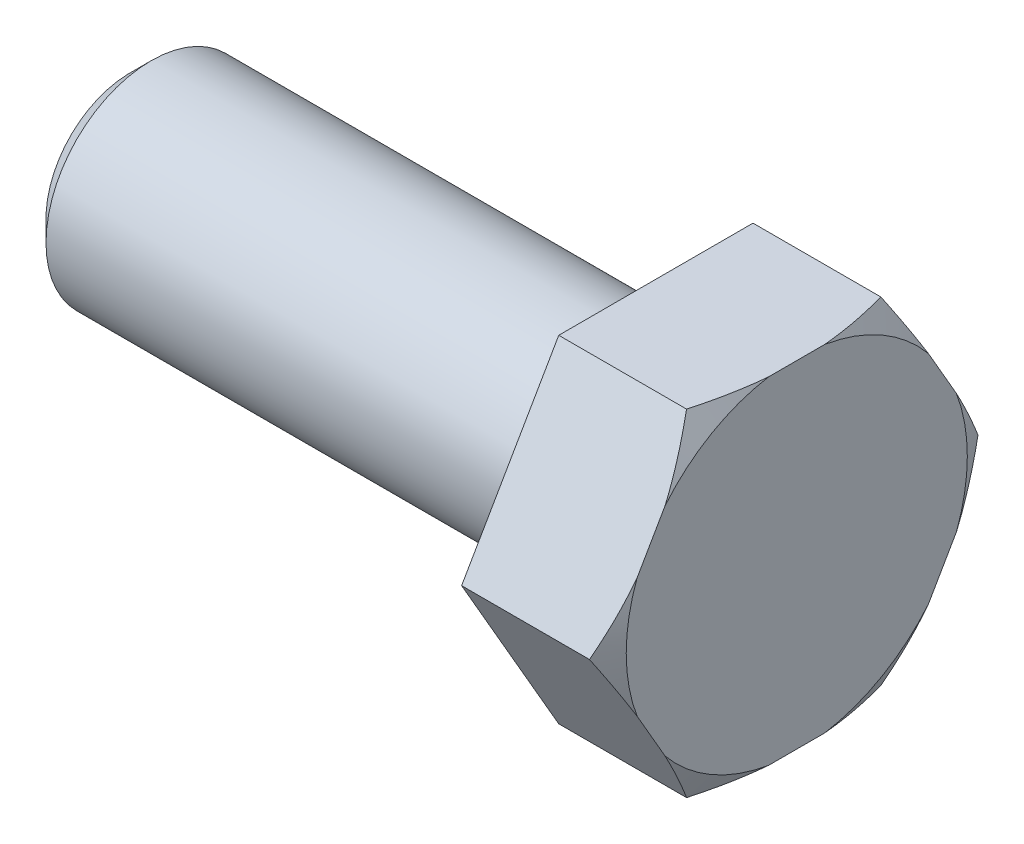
ISO-10303-21;
HEADER;
FILE_DESCRIPTION(('STEP AP214'),'2;1');
FILE_NAME('part.step','',(''),(''),'','','');
FILE_SCHEMA(('AUTOMOTIVE_DESIGN { 1 0 10303 214 1 1 1 1 }'));
ENDSEC;
DATA;
#1=APPLICATION_CONTEXT('core data for automotive mechanical design processes');
#2=APPLICATION_PROTOCOL_DEFINITION('international standard','automotive_design',2000,#1);
#3=PRODUCT_CONTEXT('',#1,'mechanical');
#4=PRODUCT('Part','Part','',(#3));
#5=PRODUCT_RELATED_PRODUCT_CATEGORY('part','',(#4));
#6=PRODUCT_DEFINITION_FORMATION('','',#4);
#7=PRODUCT_DEFINITION_CONTEXT('part definition',#1,'design');
#8=PRODUCT_DEFINITION('design','',#6,#7);
#9=PRODUCT_DEFINITION_SHAPE('','',#8);
#10=(LENGTH_UNIT() NAMED_UNIT(*) SI_UNIT(.MILLI.,.METRE.));
#11=(NAMED_UNIT(*) PLANE_ANGLE_UNIT() SI_UNIT($,.RADIAN.));
#12=(NAMED_UNIT(*) SI_UNIT($,.STERADIAN.) SOLID_ANGLE_UNIT());
#13=UNCERTAINTY_MEASURE_WITH_UNIT(LENGTH_MEASURE(1.E-05),#10,'distance_accuracy_value','');
#14=(GEOMETRIC_REPRESENTATION_CONTEXT(3) GLOBAL_UNCERTAINTY_ASSIGNED_CONTEXT((#13)) GLOBAL_UNIT_ASSIGNED_CONTEXT((#10,
#11,#12)) REPRESENTATION_CONTEXT('',''));
#15=CARTESIAN_POINT('',(0.,0.,0.));
#16=DIRECTION('',(0.,0.,1.));
#17=DIRECTION('',(1.,0.,0.));
#18=AXIS2_PLACEMENT_3D('',#15,#16,#17);
#19=CARTESIAN_POINT('',(6.0760965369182,0.,0.));
#20=DIRECTION('',(-1.,0.,0.));
#21=DIRECTION('',(0.,0.,1.));
#22=AXIS2_PLACEMENT_3D('',#19,#20,#21);
#23=CONICAL_SURFACE('',#22,9.24436993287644,1.06795311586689);
#24=CARTESIAN_POINT('',(6.70000000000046,-8.,1.33120246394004));
#25=CARTESIAN_POINT('',(6.68743687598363,-8.,1.4704052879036));
#26=CARTESIAN_POINT('',(6.6729637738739,-8.,1.60942616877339));
#27=CARTESIAN_POINT('',(6.64036612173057,-8.,1.88702809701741));
#28=CARTESIAN_POINT('',(6.6222418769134,-8.,2.02560918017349));
#29=CARTESIAN_POINT('',(6.56272269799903,-8.,2.44004829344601));
#30=CARTESIAN_POINT('',(6.51612858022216,-8.,2.71517160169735));
#31=CARTESIAN_POINT('',(6.41069439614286,-8.,3.26290457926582));
#32=CARTESIAN_POINT('',(6.35185908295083,-8.,3.53551518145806));
#33=CARTESIAN_POINT('',(6.22346386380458,-8.,4.07878654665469));
#34=CARTESIAN_POINT('',(6.15388270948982,-8.,4.34944230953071));
#35=CARTESIAN_POINT('',(6.07981763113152,-8.,4.61880215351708));
#36=B_SPLINE_CURVE_WITH_KNOTS('',3,(#24,#25,#26,#27,#28,#29,#30,#31,#32,#33,#34,#35),
.UNSPECIFIED.,.F.,.F.,(4,2,2,2,2,4),(0.,0.419276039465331,0.838517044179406,1.67528556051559,
2.51172977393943,3.34984962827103),.UNSPECIFIED.);
#37=CARTESIAN_POINT('',(6.70000000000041,-8.,1.33120246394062));
#38=VERTEX_POINT('',#37);
#39=CARTESIAN_POINT('',(6.07981763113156,-8.,4.61880215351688));
#40=VERTEX_POINT('',#39);
#41=EDGE_CURVE('E108',#38,#40,#36,.T.);
#42=ORIENTED_EDGE('',*,*,#41,.F.);
#43=CARTESIAN_POINT('',(6.70000000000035,0.,0.));
#44=DIRECTION('',(-1.,0.,0.));
#45=DIRECTION('',(0.,0.,1.));
#46=AXIS2_PLACEMENT_3D('',#43,#44,#45);
#47=CIRCLE('',#46,8.11000000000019);
#48=CARTESIAN_POINT('',(6.70000000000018,-5.1528551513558,6.26260199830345));
#49=VERTEX_POINT('',#48);
#50=EDGE_CURVE('E20',#49,#38,#47,.F.);
#51=ORIENTED_EDGE('',*,*,#50,.F.);
#52=CARTESIAN_POINT('',(6.07981763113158,-8.,4.61880215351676));
#53=CARTESIAN_POINT('',(6.15388270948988,-7.76672753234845,4.75348207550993));
#54=CARTESIAN_POINT('',(6.22346386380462,-7.53233276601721,4.88880995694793));
#55=CARTESIAN_POINT('',(6.35185908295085,-7.06184596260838,5.1604456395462));
#56=CARTESIAN_POINT('',(6.41069439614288,-6.82575825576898,5.29675094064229));
#57=CARTESIAN_POINT('',(6.51612858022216,-6.35140758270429,5.57061742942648));
#58=CARTESIAN_POINT('',(6.56272269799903,-6.11314380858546,5.70817908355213));
#59=CARTESIAN_POINT('',(6.6222418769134,-5.75422900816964,5.91539864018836));
#60=CARTESIAN_POINT('',(6.64036612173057,-5.63421426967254,5.98468918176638));
#61=CARTESIAN_POINT('',(6.6729637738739,-5.39380394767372,6.12349014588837));
#62=CARTESIAN_POINT('',(6.68743687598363,-5.27340833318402,6.19300058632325));
#63=CARTESIAN_POINT('',(6.70000000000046,-5.15285515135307,6.26260199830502));
#64=B_SPLINE_CURVE_WITH_KNOTS('',3,(#52,#53,#54,#55,#56,#57,#58,#59,#60,#61,#62,#63),
.UNSPECIFIED.,.F.,.F.,(4,2,2,2,2,4),(0.,0.838119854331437,1.67456406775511,2.51133258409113,
2.93057358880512,3.34984962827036),.UNSPECIFIED.);
#65=EDGE_CURVE('E105',#40,#49,#64,.T.);
#66=ORIENTED_EDGE('',*,*,#65,.F.);
#67=EDGE_LOOP('',(#42,#51,#66));
#68=FACE_BOUND('',#67,.T.);
#69=ADVANCED_FACE('F16',(#68),#23,.T.);
#70=CARTESIAN_POINT('',(6.0760965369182,0.,0.));
#71=DIRECTION('',(-1.,0.,0.));
#72=DIRECTION('',(0.,0.,1.));
#73=AXIS2_PLACEMENT_3D('',#70,#71,#72);
#74=CONICAL_SURFACE('',#73,9.24436993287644,1.06795311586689);
#75=CARTESIAN_POINT('',(6.70000000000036,-5.15285515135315,-6.26260199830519));
#76=CARTESIAN_POINT('',(6.68743687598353,-5.2734083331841,-6.19300058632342));
#77=CARTESIAN_POINT('',(6.67296377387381,-5.39380394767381,-6.12349014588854));
#78=CARTESIAN_POINT('',(6.64036612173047,-5.63421426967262,-5.98468918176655));
#79=CARTESIAN_POINT('',(6.6222418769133,-5.75422900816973,-5.91539864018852));
#80=CARTESIAN_POINT('',(6.56272269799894,-6.11314380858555,-5.7081790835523));
#81=CARTESIAN_POINT('',(6.51612858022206,-6.35140758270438,-5.57061742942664));
#82=CARTESIAN_POINT('',(6.41069439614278,-6.82575825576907,-5.29675094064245));
#83=CARTESIAN_POINT('',(6.35185908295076,-7.06184596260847,-5.16044563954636));
#84=CARTESIAN_POINT('',(6.22346386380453,-7.53233276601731,-4.88880995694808));
#85=CARTESIAN_POINT('',(6.15388270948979,-7.76672753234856,-4.75348207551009));
#86=CARTESIAN_POINT('',(6.0798176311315,-8.00000000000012,-4.61880215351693));
#87=B_SPLINE_CURVE_WITH_KNOTS('',3,(#75,#76,#77,#78,#79,#80,#81,#82,#83,#84,#85,#86),
.UNSPECIFIED.,.F.,.F.,(4,2,2,2,2,4),(0.,0.419276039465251,0.838517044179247,1.67528556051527,
2.51172977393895,3.34984962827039),.UNSPECIFIED.);
#88=CARTESIAN_POINT('',(6.70000000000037,-5.15285515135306,-6.26260199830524));
#89=VERTEX_POINT('',#88);
#90=CARTESIAN_POINT('',(6.07981763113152,-8.,-4.61880215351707));
#91=VERTEX_POINT('',#90);
#92=EDGE_CURVE('E232',#89,#91,#87,.T.);
#93=ORIENTED_EDGE('',*,*,#92,.F.);
#94=CARTESIAN_POINT('',(6.70000000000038,0.,0.));
#95=DIRECTION('',(-1.,0.,0.));
#96=DIRECTION('',(0.,0.,1.));
#97=AXIS2_PLACEMENT_3D('',#94,#95,#96);
#98=CIRCLE('',#97,8.11000000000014);
#99=CARTESIAN_POINT('',(6.70000000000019,-8.,-1.331202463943));
#100=VERTEX_POINT('',#99);
#101=EDGE_CURVE('E112',#100,#89,#98,.F.);
#102=ORIENTED_EDGE('',*,*,#101,.F.);
#103=CARTESIAN_POINT('',(6.0798176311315,-8.,-4.61880215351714));
#104=CARTESIAN_POINT('',(6.15388270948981,-8.,-4.34944230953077));
#105=CARTESIAN_POINT('',(6.22346386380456,-8.,-4.07878654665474));
#106=CARTESIAN_POINT('',(6.35185908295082,-8.,-3.5355151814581));
#107=CARTESIAN_POINT('',(6.41069439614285,-8.,-3.26290457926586));
#108=CARTESIAN_POINT('',(6.51612858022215,-8.,-2.71517160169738));
#109=CARTESIAN_POINT('',(6.56272269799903,-8.,-2.44004829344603));
#110=CARTESIAN_POINT('',(6.6222418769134,-8.,-2.0256091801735));
#111=CARTESIAN_POINT('',(6.64036612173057,-8.,-1.88702809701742));
#112=CARTESIAN_POINT('',(6.6729637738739,-8.,-1.6094261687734));
#113=CARTESIAN_POINT('',(6.68743687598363,-8.,-1.47040528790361));
#114=CARTESIAN_POINT('',(6.70000000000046,-8.,-1.33120246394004));
#115=B_SPLINE_CURVE_WITH_KNOTS('',3,(#103,#104,#105,#106,#107,#108,#109,#110,#111,#112,#113,
#114),.UNSPECIFIED.,.F.,.F.,(4,2,2,2,2,4),(0.,0.83811985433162,1.67456406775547,
2.51133258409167,2.93057358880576,3.3498496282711),.UNSPECIFIED.);
#116=EDGE_CURVE('E253',#91,#100,#115,.T.);
#117=ORIENTED_EDGE('',*,*,#116,.F.);
#118=EDGE_LOOP('',(#93,#102,#117));
#119=FACE_BOUND('',#118,.T.);
#120=ADVANCED_FACE('F248',(#119),#74,.T.);
#121=CARTESIAN_POINT('',(6.0760965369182,0.,0.));
#122=DIRECTION('',(-1.,0.,0.));
#123=DIRECTION('',(0.,0.,1.));
#124=AXIS2_PLACEMENT_3D('',#121,#122,#123);
#125=CONICAL_SURFACE('',#124,9.24436993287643,1.06795311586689);
#126=CARTESIAN_POINT('',(6.70000000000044,2.84714484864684,-7.59380446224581));
#127=CARTESIAN_POINT('',(6.68743687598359,2.72659166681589,-7.66340587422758));
#128=CARTESIAN_POINT('',(6.67296377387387,2.60619605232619,-7.73291631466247));
#129=CARTESIAN_POINT('',(6.64036612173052,2.36578573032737,-7.87171727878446));
#130=CARTESIAN_POINT('',(6.62224187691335,2.24577099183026,-7.94100782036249));
#131=CARTESIAN_POINT('',(6.56272269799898,1.88685619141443,-8.14822737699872));
#132=CARTESIAN_POINT('',(6.5161285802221,1.6485924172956,-8.28578903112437));
#133=CARTESIAN_POINT('',(6.4106943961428,1.1742417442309,-8.55965551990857));
#134=CARTESIAN_POINT('',(6.35185908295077,0.938154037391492,-8.69596082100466));
#135=CARTESIAN_POINT('',(6.22346386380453,0.467667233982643,-8.96759650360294));
#136=CARTESIAN_POINT('',(6.15388270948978,0.233272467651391,-9.10292438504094));
#137=CARTESIAN_POINT('',(6.07981763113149,-1.71825817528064E-13,-9.2376043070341));
#138=B_SPLINE_CURVE_WITH_KNOTS('',3,(#126,#127,#128,#129,#130,#131,#132,#133,#134,#135,#136,
#137),.UNSPECIFIED.,.F.,.F.,(4,2,2,2,2,4),(0.,0.41927603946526,0.838517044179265,
1.67528556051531,2.511729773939,3.34984962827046),.UNSPECIFIED.);
#139=CARTESIAN_POINT('',(6.70000000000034,2.8471448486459,-7.59380446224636));
#140=VERTEX_POINT('',#139);
#141=CARTESIAN_POINT('',(6.07981763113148,0.,-9.23760430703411));
#142=VERTEX_POINT('',#141);
#143=EDGE_CURVE('E227',#140,#142,#138,.T.);
#144=ORIENTED_EDGE('',*,*,#143,.F.);
#145=CARTESIAN_POINT('',(6.70000000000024,0.,0.));
#146=DIRECTION('',(-1.,0.,0.));
#147=DIRECTION('',(0.,0.,1.));
#148=AXIS2_PLACEMENT_3D('',#145,#146,#147);
#149=CIRCLE('',#148,8.1100000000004);
#150=CARTESIAN_POINT('',(6.70000000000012,-2.84714484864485,-7.59380446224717));
#151=VERTEX_POINT('',#150);
#152=EDGE_CURVE('E438',#151,#140,#149,.F.);
#153=ORIENTED_EDGE('',*,*,#152,.F.);
#154=CARTESIAN_POINT('',(6.07981763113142,0.,-9.23760430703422));
#155=CARTESIAN_POINT('',(6.15388270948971,-0.233272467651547,-9.10292438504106));
#156=CARTESIAN_POINT('',(6.22346386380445,-0.467667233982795,-8.96759650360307));
#157=CARTESIAN_POINT('',(6.35185908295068,-0.938154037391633,-8.6959608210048));
#158=CARTESIAN_POINT('',(6.41069439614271,-1.17424174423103,-8.5596555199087));
#159=CARTESIAN_POINT('',(6.51612858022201,-1.64859241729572,-8.28578903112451));
#160=CARTESIAN_POINT('',(6.56272269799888,-1.88685619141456,-8.14822737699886));
#161=CARTESIAN_POINT('',(6.62224187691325,-2.24577099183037,-7.94100782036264));
#162=CARTESIAN_POINT('',(6.64036612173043,-2.36578573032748,-7.87171727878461));
#163=CARTESIAN_POINT('',(6.67296377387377,-2.60619605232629,-7.73291631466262));
#164=CARTESIAN_POINT('',(6.68743687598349,-2.72659166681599,-7.66340587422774));
#165=CARTESIAN_POINT('',(6.70000000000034,-2.84714484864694,-7.59380446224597));
#166=B_SPLINE_CURVE_WITH_KNOTS('',3,(#154,#155,#156,#157,#158,#159,#160,#161,#162,#163,#164,
#165),.UNSPECIFIED.,.F.,.F.,(4,2,2,2,2,4),(0.,0.838119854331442,1.67456406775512,
2.51133258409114,2.93057358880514,3.34984962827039),.UNSPECIFIED.);
#167=EDGE_CURVE('E240',#142,#151,#166,.T.);
#168=ORIENTED_EDGE('',*,*,#167,.F.);
#169=EDGE_LOOP('',(#144,#153,#168));
#170=FACE_BOUND('',#169,.T.);
#171=ADVANCED_FACE('F212',(#170),#125,.T.);
#172=CARTESIAN_POINT('',(6.0760965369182,0.,0.));
#173=DIRECTION('',(-1.,0.,0.));
#174=DIRECTION('',(0.,0.,1.));
#175=AXIS2_PLACEMENT_3D('',#172,#173,#174);
#176=CONICAL_SURFACE('',#175,9.24436993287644,1.06795311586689);
#177=CARTESIAN_POINT('',(6.70000000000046,8.,-1.33120246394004));
#178=CARTESIAN_POINT('',(6.68743687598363,8.,-1.4704052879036));
#179=CARTESIAN_POINT('',(6.6729637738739,8.,-1.60942616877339));
#180=CARTESIAN_POINT('',(6.64036612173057,8.,-1.88702809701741));
#181=CARTESIAN_POINT('',(6.6222418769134,8.,-2.02560918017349));
#182=CARTESIAN_POINT('',(6.56272269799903,8.,-2.44004829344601));
#183=CARTESIAN_POINT('',(6.51612858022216,8.,-2.71517160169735));
#184=CARTESIAN_POINT('',(6.41069439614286,8.,-3.26290457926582));
#185=CARTESIAN_POINT('',(6.35185908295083,8.,-3.53551518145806));
#186=CARTESIAN_POINT('',(6.22346386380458,8.,-4.07878654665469));
#187=CARTESIAN_POINT('',(6.15388270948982,8.,-4.34944230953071));
#188=CARTESIAN_POINT('',(6.07981763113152,8.,-4.61880215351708));
#189=B_SPLINE_CURVE_WITH_KNOTS('',3,(#177,#178,#179,#180,#181,#182,#183,#184,#185,#186,#187,
#188),.UNSPECIFIED.,.F.,.F.,(4,2,2,2,2,4),(0.,0.419276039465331,0.838517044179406,
1.67528556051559,2.51172977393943,3.34984962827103),.UNSPECIFIED.);
#190=CARTESIAN_POINT('',(6.70000000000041,8.,-1.33120246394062));
#191=VERTEX_POINT('',#190);
#192=CARTESIAN_POINT('',(6.07981763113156,8.,-4.61880215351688));
#193=VERTEX_POINT('',#192);
#194=EDGE_CURVE('E198',#191,#193,#189,.T.);
#195=ORIENTED_EDGE('',*,*,#194,.F.);
#196=CARTESIAN_POINT('',(6.70000000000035,0.,0.));
#197=DIRECTION('',(-1.,0.,0.));
#198=DIRECTION('',(0.,0.,1.));
#199=AXIS2_PLACEMENT_3D('',#196,#197,#198);
#200=CIRCLE('',#199,8.11000000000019);
#201=CARTESIAN_POINT('',(6.70000000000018,5.1528551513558,-6.26260199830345));
#202=VERTEX_POINT('',#201);
#203=EDGE_CURVE('E479',#202,#191,#200,.F.);
#204=ORIENTED_EDGE('',*,*,#203,.F.);
#205=CARTESIAN_POINT('',(6.07981763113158,8.,-4.61880215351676));
#206=CARTESIAN_POINT('',(6.15388270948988,7.76672753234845,-4.75348207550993));
#207=CARTESIAN_POINT('',(6.22346386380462,7.53233276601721,-4.88880995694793));
#208=CARTESIAN_POINT('',(6.35185908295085,7.06184596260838,-5.1604456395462));
#209=CARTESIAN_POINT('',(6.41069439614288,6.82575825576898,-5.29675094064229));
#210=CARTESIAN_POINT('',(6.51612858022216,6.35140758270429,-5.57061742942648));
#211=CARTESIAN_POINT('',(6.56272269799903,6.11314380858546,-5.70817908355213));
#212=CARTESIAN_POINT('',(6.6222418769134,5.75422900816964,-5.91539864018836));
#213=CARTESIAN_POINT('',(6.64036612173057,5.63421426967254,-5.98468918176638));
#214=CARTESIAN_POINT('',(6.6729637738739,5.39380394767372,-6.12349014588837));
#215=CARTESIAN_POINT('',(6.68743687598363,5.27340833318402,-6.19300058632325));
#216=CARTESIAN_POINT('',(6.70000000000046,5.15285515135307,-6.26260199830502));
#217=B_SPLINE_CURVE_WITH_KNOTS('',3,(#205,#206,#207,#208,#209,#210,#211,#212,#213,#214,#215,
#216),.UNSPECIFIED.,.F.,.F.,(4,2,2,2,2,4),(0.,0.838119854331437,1.67456406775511,
2.51133258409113,2.93057358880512,3.34984962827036),.UNSPECIFIED.);
#218=EDGE_CURVE('E218',#193,#202,#217,.T.);
#219=ORIENTED_EDGE('',*,*,#218,.F.);
#220=EDGE_LOOP('',(#195,#204,#219));
#221=FACE_BOUND('',#220,.T.);
#222=ADVANCED_FACE('F207',(#221),#176,.T.);
#223=CARTESIAN_POINT('',(6.0760965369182,0.,0.));
#224=DIRECTION('',(-1.,0.,0.));
#225=DIRECTION('',(0.,0.,1.));
#226=AXIS2_PLACEMENT_3D('',#223,#224,#225);
#227=CONICAL_SURFACE('',#226,9.24436993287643,1.06795311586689);
#228=CARTESIAN_POINT('',(6.07981763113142,0.,9.23760430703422));
#229=CARTESIAN_POINT('',(6.15388270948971,0.233272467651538,9.10292438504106));
#230=CARTESIAN_POINT('',(6.22346386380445,0.467667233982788,8.96759650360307));
#231=CARTESIAN_POINT('',(6.35185908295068,0.938154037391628,8.6959608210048));
#232=CARTESIAN_POINT('',(6.41069439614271,1.17424174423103,8.5596555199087));
#233=CARTESIAN_POINT('',(6.51612858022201,1.64859241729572,8.28578903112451));
#234=CARTESIAN_POINT('',(6.56272269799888,1.88685619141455,8.14822737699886));
#235=CARTESIAN_POINT('',(6.62224187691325,2.24577099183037,7.94100782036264));
#236=CARTESIAN_POINT('',(6.64036612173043,2.36578573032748,7.87171727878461));
#237=CARTESIAN_POINT('',(6.67296377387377,2.60619605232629,7.73291631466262));
#238=CARTESIAN_POINT('',(6.68743687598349,2.72659166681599,7.66340587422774));
#239=CARTESIAN_POINT('',(6.70000000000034,2.84714484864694,7.59380446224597));
#240=B_SPLINE_CURVE_WITH_KNOTS('',3,(#228,#229,#230,#231,#232,#233,#234,#235,#236,#237,#238,
#239),.UNSPECIFIED.,.F.,.F.,(4,2,2,2,2,4),(0.,0.838119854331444,1.67456406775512,
2.51133258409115,2.93057358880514,3.3498496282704),.UNSPECIFIED.);
#241=CARTESIAN_POINT('',(6.07981763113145,0.,9.23760430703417));
#242=VERTEX_POINT('',#241);
#243=CARTESIAN_POINT('',(6.70000000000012,2.84714484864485,7.59380446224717));
#244=VERTEX_POINT('',#243);
#245=EDGE_CURVE('E178',#242,#244,#240,.T.);
#246=ORIENTED_EDGE('',*,*,#245,.F.);
#247=CARTESIAN_POINT('',(6.70000000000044,-2.84714484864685,7.59380446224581));
#248=CARTESIAN_POINT('',(6.68743687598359,-2.72659166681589,7.66340587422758));
#249=CARTESIAN_POINT('',(6.67296377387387,-2.60619605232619,7.73291631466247));
#250=CARTESIAN_POINT('',(6.64036612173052,-2.36578573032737,7.87171727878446));
#251=CARTESIAN_POINT('',(6.62224187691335,-2.24577099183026,7.94100782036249));
#252=CARTESIAN_POINT('',(6.56272269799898,-1.88685619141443,8.14822737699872));
#253=CARTESIAN_POINT('',(6.5161285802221,-1.64859241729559,8.28578903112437));
#254=CARTESIAN_POINT('',(6.4106943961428,-1.17424174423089,8.55965551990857));
#255=CARTESIAN_POINT('',(6.35185908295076,-0.938154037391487,8.69596082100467));
#256=CARTESIAN_POINT('',(6.22346386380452,-0.467667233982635,8.96759650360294));
#257=CARTESIAN_POINT('',(6.15388270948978,-0.233272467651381,9.10292438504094));
#258=CARTESIAN_POINT('',(6.07981763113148,1.84004511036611E-13,9.2376043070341));
#259=B_SPLINE_CURVE_WITH_KNOTS('',3,(#247,#248,#249,#250,#251,#252,#253,#254,#255,#256,#257,
#258),.UNSPECIFIED.,.F.,.F.,(4,2,2,2,2,4),(0.,0.419276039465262,0.838517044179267,
1.67528556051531,2.51172977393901,3.34984962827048),.UNSPECIFIED.);
#260=CARTESIAN_POINT('',(6.70000000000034,-2.8471448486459,7.59380446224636));
#261=VERTEX_POINT('',#260);
#262=EDGE_CURVE('E120',#261,#242,#259,.T.);
#263=ORIENTED_EDGE('',*,*,#262,.F.);
#264=CARTESIAN_POINT('',(6.70000000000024,0.,0.));
#265=DIRECTION('',(-1.,0.,0.));
#266=DIRECTION('',(0.,0.,1.));
#267=AXIS2_PLACEMENT_3D('',#264,#265,#266);
#268=CIRCLE('',#267,8.1100000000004);
#269=EDGE_CURVE('E117',#244,#261,#268,.F.);
#270=ORIENTED_EDGE('',*,*,#269,.F.);
#271=EDGE_LOOP('',(#246,#263,#270));
#272=FACE_BOUND('',#271,.T.);
#273=ADVANCED_FACE('F211',(#272),#227,.T.);
#274=CARTESIAN_POINT('',(6.7,0.,0.));
#275=DIRECTION('',(1.,0.,0.));
#276=DIRECTION('',(0.,0.,-1.));
#277=AXIS2_PLACEMENT_3D('',#274,#275,#276);
#278=PLANE('',#277);
#279=DIRECTION('',(0.,-0.866025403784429,0.500000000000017));
#280=VECTOR('',#279,1.);
#281=CARTESIAN_POINT('',(6.7,8.,4.618802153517));
#282=LINE('',#281,#280);
#283=CARTESIAN_POINT('',(6.70000000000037,5.15285515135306,6.26260199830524));
#284=VERTEX_POINT('',#283);
#285=EDGE_CURVE('E175',#244,#284,#282,.F.);
#286=ORIENTED_EDGE('',*,*,#285,.F.);
#287=ORIENTED_EDGE('',*,*,#269,.T.);
#288=DIRECTION('',(0.,-0.866025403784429,-0.500000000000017));
#289=VECTOR('',#288,1.);
#290=CARTESIAN_POINT('',(6.7,0.,9.237604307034));
#291=LINE('',#290,#289);
#292=EDGE_CURVE('E114',#49,#261,#291,.F.);
#293=ORIENTED_EDGE('',*,*,#292,.F.);
#294=ORIENTED_EDGE('',*,*,#50,.T.);
#295=DIRECTION('',(0.,0.,-1.));
#296=VECTOR('',#295,1.);
#297=CARTESIAN_POINT('',(6.7,-8.,4.618802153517));
#298=LINE('',#297,#296);
#299=EDGE_CURVE('E259',#100,#38,#298,.F.);
#300=ORIENTED_EDGE('',*,*,#299,.F.);
#301=ORIENTED_EDGE('',*,*,#101,.T.);
#302=DIRECTION('',(0.,0.866025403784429,-0.500000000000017));
#303=VECTOR('',#302,1.);
#304=CARTESIAN_POINT('',(6.7,-8.,-4.618802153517));
#305=LINE('',#304,#303);
#306=EDGE_CURVE('E239',#151,#89,#305,.F.);
#307=ORIENTED_EDGE('',*,*,#306,.F.);
#308=ORIENTED_EDGE('',*,*,#152,.T.);
#309=DIRECTION('',(0.,0.866025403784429,0.500000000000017));
#310=VECTOR('',#309,1.);
#311=CARTESIAN_POINT('',(6.7,0.,-9.237604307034));
#312=LINE('',#311,#310);
#313=EDGE_CURVE('E225',#202,#140,#312,.F.);
#314=ORIENTED_EDGE('',*,*,#313,.F.);
#315=ORIENTED_EDGE('',*,*,#203,.T.);
#316=DIRECTION('',(0.,0.,1.));
#317=VECTOR('',#316,1.);
#318=CARTESIAN_POINT('',(6.7,8.,-4.618802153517));
#319=LINE('',#318,#317);
#320=CARTESIAN_POINT('',(6.70000000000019,8.,1.331202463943));
#321=VERTEX_POINT('',#320);
#322=EDGE_CURVE('E206',#321,#191,#319,.F.);
#323=ORIENTED_EDGE('',*,*,#322,.F.);
#324=CARTESIAN_POINT('',(6.70000000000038,0.,0.));
#325=DIRECTION('',(-1.,0.,0.));
#326=DIRECTION('',(0.,0.,1.));
#327=AXIS2_PLACEMENT_3D('',#324,#325,#326);
#328=CIRCLE('',#327,8.11000000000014);
#329=EDGE_CURVE('E125',#284,#321,#328,.T.);
#330=ORIENTED_EDGE('',*,*,#329,.F.);
#331=EDGE_LOOP('',(#286,#287,#293,#294,#300,#301,#307,#308,#314,#315,#323,#330));
#332=FACE_BOUND('',#331,.T.);
#333=ADVANCED_FACE('F116',(#332),#278,.T.);
#334=CARTESIAN_POINT('',(6.0760965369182,0.,0.));
#335=DIRECTION('',(-1.,0.,0.));
#336=DIRECTION('',(0.,0.,1.));
#337=AXIS2_PLACEMENT_3D('',#334,#335,#336);
#338=CONICAL_SURFACE('',#337,9.24436993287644,1.06795311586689);
#339=CARTESIAN_POINT('',(6.70000000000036,5.15285515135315,6.26260199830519));
#340=CARTESIAN_POINT('',(6.68743687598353,5.2734083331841,6.19300058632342));
#341=CARTESIAN_POINT('',(6.6729637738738,5.3938039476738,6.12349014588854));
#342=CARTESIAN_POINT('',(6.64036612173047,5.63421426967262,5.98468918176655));
#343=CARTESIAN_POINT('',(6.6222418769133,5.75422900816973,5.91539864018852));
#344=CARTESIAN_POINT('',(6.56272269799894,6.11314380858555,5.7081790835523));
#345=CARTESIAN_POINT('',(6.51612858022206,6.35140758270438,5.57061742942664));
#346=CARTESIAN_POINT('',(6.41069439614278,6.82575825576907,5.29675094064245));
#347=CARTESIAN_POINT('',(6.35185908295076,7.06184596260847,5.16044563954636));
#348=CARTESIAN_POINT('',(6.22346386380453,7.53233276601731,4.88880995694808));
#349=CARTESIAN_POINT('',(6.15388270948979,7.76672753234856,4.75348207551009));
#350=CARTESIAN_POINT('',(6.0798176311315,8.00000000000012,4.61880215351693));
#351=B_SPLINE_CURVE_WITH_KNOTS('',3,(#339,#340,#341,#342,#343,#344,#345,#346,#347,#348,#349,
#350),.UNSPECIFIED.,.F.,.F.,(4,2,2,2,2,4),(0.,0.41927603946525,0.838517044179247,
1.67528556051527,2.51172977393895,3.34984962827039),.UNSPECIFIED.);
#352=CARTESIAN_POINT('',(6.07981763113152,8.,4.61880215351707));
#353=VERTEX_POINT('',#352);
#354=EDGE_CURVE('E165',#284,#353,#351,.T.);
#355=ORIENTED_EDGE('',*,*,#354,.F.);
#356=ORIENTED_EDGE('',*,*,#329,.T.);
#357=CARTESIAN_POINT('',(6.0798176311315,8.,4.61880215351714));
#358=CARTESIAN_POINT('',(6.15388270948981,8.,4.34944230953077));
#359=CARTESIAN_POINT('',(6.22346386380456,8.,4.07878654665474));
#360=CARTESIAN_POINT('',(6.35185908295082,8.,3.5355151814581));
#361=CARTESIAN_POINT('',(6.41069439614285,8.,3.26290457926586));
#362=CARTESIAN_POINT('',(6.51612858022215,8.,2.71517160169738));
#363=CARTESIAN_POINT('',(6.56272269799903,8.,2.44004829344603));
#364=CARTESIAN_POINT('',(6.6222418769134,8.,2.0256091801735));
#365=CARTESIAN_POINT('',(6.64036612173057,8.,1.88702809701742));
#366=CARTESIAN_POINT('',(6.6729637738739,8.,1.6094261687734));
#367=CARTESIAN_POINT('',(6.68743687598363,8.,1.47040528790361));
#368=CARTESIAN_POINT('',(6.70000000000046,8.,1.33120246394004));
#369=B_SPLINE_CURVE_WITH_KNOTS('',3,(#357,#358,#359,#360,#361,#362,#363,#364,#365,#366,#367,
#368),.UNSPECIFIED.,.F.,.F.,(4,2,2,2,2,4),(0.,0.83811985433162,1.67456406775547,
2.51133258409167,2.93057358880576,3.3498496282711),.UNSPECIFIED.);
#370=EDGE_CURVE('E156',#353,#321,#369,.T.);
#371=ORIENTED_EDGE('',*,*,#370,.F.);
#372=EDGE_LOOP('',(#355,#356,#371));
#373=FACE_BOUND('',#372,.T.);
#374=ADVANCED_FACE('F146',(#373),#338,.T.);
#375=CARTESIAN_POINT('',(0.,0.,9.237604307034));
#376=DIRECTION('',(0.,-0.500000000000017,0.866025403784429));
#377=DIRECTION('',(0.,-0.866025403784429,-0.500000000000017));
#378=AXIS2_PLACEMENT_3D('',#375,#376,#377);
#379=PLANE('',#378);
#380=ORIENTED_EDGE('',*,*,#292,.T.);
#381=ORIENTED_EDGE('',*,*,#262,.T.);
#382=DIRECTION('',(1.,0.,0.));
#383=VECTOR('',#382,1.);
#384=CARTESIAN_POINT('',(0.,0.,9.23760430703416));
#385=LINE('',#384,#383);
#386=CARTESIAN_POINT('',(0.,0.,9.23760430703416));
#387=VERTEX_POINT('',#386);
#388=EDGE_CURVE('E465',#387,#242,#385,.T.);
#389=ORIENTED_EDGE('',*,*,#388,.F.);
#390=DIRECTION('',(0.,-0.866025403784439,-0.5));
#391=VECTOR('',#390,1.);
#392=CARTESIAN_POINT('',(0.,0.,9.237604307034));
#393=LINE('',#392,#391);
#394=CARTESIAN_POINT('',(0.,-8.,4.61880215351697));
#395=VERTEX_POINT('',#394);
#396=EDGE_CURVE('E174',#387,#395,#393,.T.);
#397=ORIENTED_EDGE('',*,*,#396,.T.);
#398=DIRECTION('',(1.,0.,0.));
#399=VECTOR('',#398,1.);
#400=CARTESIAN_POINT('',(0.,-8.,4.618802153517));
#401=LINE('',#400,#399);
#402=EDGE_CURVE('E124',#40,#395,#401,.F.);
#403=ORIENTED_EDGE('',*,*,#402,.F.);
#404=ORIENTED_EDGE('',*,*,#65,.T.);
#405=EDGE_LOOP('',(#380,#381,#389,#397,#403,#404));
#406=FACE_BOUND('',#405,.T.);
#407=ADVANCED_FACE('F122',(#406),#379,.T.);
#408=CARTESIAN_POINT('',(0.,-8.,4.618802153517));
#409=DIRECTION('',(0.,-1.,0.));
#410=DIRECTION('',(0.,0.,-1.));
#411=AXIS2_PLACEMENT_3D('',#408,#409,#410);
#412=PLANE('',#411);
#413=ORIENTED_EDGE('',*,*,#299,.T.);
#414=ORIENTED_EDGE('',*,*,#41,.T.);
#415=ORIENTED_EDGE('',*,*,#402,.T.);
#416=DIRECTION('',(0.,0.,-1.));
#417=VECTOR('',#416,1.);
#418=CARTESIAN_POINT('',(0.,-8.,0.));
#419=LINE('',#418,#417);
#420=CARTESIAN_POINT('',(0.,-8.,-4.618802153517));
#421=VERTEX_POINT('',#420);
#422=EDGE_CURVE('E281',#395,#421,#419,.T.);
#423=ORIENTED_EDGE('',*,*,#422,.T.);
#424=DIRECTION('',(1.,0.,0.));
#425=VECTOR('',#424,1.);
#426=CARTESIAN_POINT('',(0.,-8.,-4.618802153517));
#427=LINE('',#426,#425);
#428=EDGE_CURVE('E264',#91,#421,#427,.F.);
#429=ORIENTED_EDGE('',*,*,#428,.F.);
#430=ORIENTED_EDGE('',*,*,#116,.T.);
#431=EDGE_LOOP('',(#413,#414,#415,#423,#429,#430));
#432=FACE_BOUND('',#431,.T.);
#433=ADVANCED_FACE('F145',(#432),#412,.T.);
#434=CARTESIAN_POINT('',(0.,-8.,-4.618802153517));
#435=DIRECTION('',(0.,-0.500000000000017,-0.866025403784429));
#436=DIRECTION('',(0.,0.866025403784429,-0.500000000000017));
#437=AXIS2_PLACEMENT_3D('',#434,#435,#436);
#438=PLANE('',#437);
#439=ORIENTED_EDGE('',*,*,#306,.T.);
#440=ORIENTED_EDGE('',*,*,#92,.T.);
#441=ORIENTED_EDGE('',*,*,#428,.T.);
#442=DIRECTION('',(0.,0.866025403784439,-0.5));
#443=VECTOR('',#442,1.);
#444=CARTESIAN_POINT('',(0.,-8.,-4.618802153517));
#445=LINE('',#444,#443);
#446=CARTESIAN_POINT('',(0.,0.,-9.23760430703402));
#447=VERTEX_POINT('',#446);
#448=EDGE_CURVE('E289',#421,#447,#445,.T.);
#449=ORIENTED_EDGE('',*,*,#448,.T.);
#450=DIRECTION('',(1.,0.,0.));
#451=VECTOR('',#450,1.);
#452=CARTESIAN_POINT('',(0.,0.,-9.237604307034));
#453=LINE('',#452,#451);
#454=EDGE_CURVE('E226',#142,#447,#453,.F.);
#455=ORIENTED_EDGE('',*,*,#454,.F.);
#456=ORIENTED_EDGE('',*,*,#167,.T.);
#457=EDGE_LOOP('',(#439,#440,#441,#449,#455,#456));
#458=FACE_BOUND('',#457,.T.);
#459=ADVANCED_FACE('F246',(#458),#438,.T.);
#460=CARTESIAN_POINT('',(0.,0.,-9.237604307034));
#461=DIRECTION('',(0.,0.500000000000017,-0.866025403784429));
#462=DIRECTION('',(0.,0.866025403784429,0.500000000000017));
#463=AXIS2_PLACEMENT_3D('',#460,#461,#462);
#464=PLANE('',#463);
#465=ORIENTED_EDGE('',*,*,#313,.T.);
#466=ORIENTED_EDGE('',*,*,#143,.T.);
#467=ORIENTED_EDGE('',*,*,#454,.T.);
#468=DIRECTION('',(0.,0.866025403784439,0.5));
#469=VECTOR('',#468,1.);
#470=CARTESIAN_POINT('',(0.,0.,-9.237604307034));
#471=LINE('',#470,#469);
#472=CARTESIAN_POINT('',(0.,8.,-4.61880215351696));
#473=VERTEX_POINT('',#472);
#474=EDGE_CURVE('E285',#447,#473,#471,.T.);
#475=ORIENTED_EDGE('',*,*,#474,.T.);
#476=DIRECTION('',(1.,0.,0.));
#477=VECTOR('',#476,1.);
#478=CARTESIAN_POINT('',(0.,8.,-4.618802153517));
#479=LINE('',#478,#477);
#480=EDGE_CURVE('E443',#193,#473,#479,.F.);
#481=ORIENTED_EDGE('',*,*,#480,.F.);
#482=ORIENTED_EDGE('',*,*,#218,.T.);
#483=EDGE_LOOP('',(#465,#466,#467,#475,#481,#482));
#484=FACE_BOUND('',#483,.T.);
#485=ADVANCED_FACE('F195',(#484),#464,.T.);
#486=CARTESIAN_POINT('',(0.,8.,-4.618802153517));
#487=DIRECTION('',(0.,1.,0.));
#488=DIRECTION('',(0.,0.,1.));
#489=AXIS2_PLACEMENT_3D('',#486,#487,#488);
#490=PLANE('',#489);
#491=ORIENTED_EDGE('',*,*,#322,.T.);
#492=ORIENTED_EDGE('',*,*,#194,.T.);
#493=ORIENTED_EDGE('',*,*,#480,.T.);
#494=DIRECTION('',(0.,0.,-1.));
#495=VECTOR('',#494,1.);
#496=CARTESIAN_POINT('',(0.,8.,0.));
#497=LINE('',#496,#495);
#498=CARTESIAN_POINT('',(0.,8.,4.618802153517));
#499=VERTEX_POINT('',#498);
#500=EDGE_CURVE('E35',#473,#499,#497,.F.);
#501=ORIENTED_EDGE('',*,*,#500,.T.);
#502=DIRECTION('',(1.,0.,0.));
#503=VECTOR('',#502,1.);
#504=CARTESIAN_POINT('',(0.,8.,4.618802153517));
#505=LINE('',#504,#503);
#506=EDGE_CURVE('E205',#353,#499,#505,.F.);
#507=ORIENTED_EDGE('',*,*,#506,.F.);
#508=ORIENTED_EDGE('',*,*,#370,.T.);
#509=EDGE_LOOP('',(#491,#492,#493,#501,#507,#508));
#510=FACE_BOUND('',#509,.T.);
#511=ADVANCED_FACE('F188',(#510),#490,.T.);
#512=CARTESIAN_POINT('',(0.,8.,4.618802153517));
#513=DIRECTION('',(0.,0.500000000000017,0.866025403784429));
#514=DIRECTION('',(0.,-0.866025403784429,0.500000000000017));
#515=AXIS2_PLACEMENT_3D('',#512,#513,#514);
#516=PLANE('',#515);
#517=ORIENTED_EDGE('',*,*,#285,.T.);
#518=ORIENTED_EDGE('',*,*,#354,.T.);
#519=ORIENTED_EDGE('',*,*,#506,.T.);
#520=DIRECTION('',(0.,-0.866025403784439,0.5));
#521=VECTOR('',#520,1.);
#522=CARTESIAN_POINT('',(0.,8.,4.618802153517));
#523=LINE('',#522,#521);
#524=EDGE_CURVE('E275',#499,#387,#523,.T.);
#525=ORIENTED_EDGE('',*,*,#524,.T.);
#526=ORIENTED_EDGE('',*,*,#388,.T.);
#527=ORIENTED_EDGE('',*,*,#245,.T.);
#528=EDGE_LOOP('',(#517,#518,#519,#525,#526,#527));
#529=FACE_BOUND('',#528,.T.);
#530=ADVANCED_FACE('F183',(#529),#516,.T.);
#531=CARTESIAN_POINT('',(-25.,0.,0.));
#532=DIRECTION('',(-1.,0.,0.));
#533=DIRECTION('',(0.,0.,1.));
#534=AXIS2_PLACEMENT_3D('',#531,#532,#533);
#535=PLANE('',#534);
#536=CARTESIAN_POINT('',(-25.0000000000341,0.,0.));
#537=DIRECTION('',(1.,0.,0.));
#538=DIRECTION('',(0.,0.,-1.));
#539=AXIS2_PLACEMENT_3D('',#536,#537,#538);
#540=CIRCLE('',#539,3.99999999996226);
#541=CARTESIAN_POINT('',(-25.0000000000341,0.,-3.99999999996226));
#542=VERTEX_POINT('',#541);
#543=EDGE_CURVE('E176',#542,#542,#540,.T.);
#544=ORIENTED_EDGE('',*,*,#543,.F.);
#545=EDGE_LOOP('',(#544));
#546=FACE_BOUND('',#545,.T.);
#547=ADVANCED_FACE('F187',(#546),#535,.T.);
#548=CARTESIAN_POINT('',(0.,0.,0.));
#549=DIRECTION('',(1.,0.,0.));
#550=DIRECTION('',(0.,0.,-1.));
#551=AXIS2_PLACEMENT_3D('',#548,#549,#550);
#552=PLANE('',#551);
#553=CARTESIAN_POINT('',(0.,0.,0.));
#554=DIRECTION('',(-1.,0.,0.));
#555=DIRECTION('',(0.,0.,1.));
#556=AXIS2_PLACEMENT_3D('',#553,#554,#555);
#557=CIRCLE('',#556,5.);
#558=CARTESIAN_POINT('',(0.,0.,5.));
#559=VERTEX_POINT('',#558);
#560=EDGE_CURVE('E26',#559,#559,#557,.T.);
#561=ORIENTED_EDGE('',*,*,#560,.F.);
#562=EDGE_LOOP('',(#561));
#563=FACE_BOUND('',#562,.T.);
#564=ORIENTED_EDGE('',*,*,#500,.F.);
#565=ORIENTED_EDGE('',*,*,#474,.F.);
#566=ORIENTED_EDGE('',*,*,#448,.F.);
#567=ORIENTED_EDGE('',*,*,#422,.F.);
#568=ORIENTED_EDGE('',*,*,#396,.F.);
#569=ORIENTED_EDGE('',*,*,#524,.F.);
#570=EDGE_LOOP('',(#564,#565,#566,#567,#568,#569));
#571=FACE_BOUND('',#570,.T.);
#572=ADVANCED_FACE('F306',(#563,#571),#552,.F.);
#573=CARTESIAN_POINT('',(-24.0000000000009,0.,0.));
#574=DIRECTION('',(1.,0.,0.));
#575=DIRECTION('',(0.,0.,-1.));
#576=AXIS2_PLACEMENT_3D('',#573,#574,#575);
#577=CONICAL_SURFACE('',#576,4.99999999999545,0.785398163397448);
#578=CARTESIAN_POINT('',(-24.,0.,0.));
#579=DIRECTION('',(-1.,0.,0.));
#580=DIRECTION('',(0.,0.,1.));
#581=AXIS2_PLACEMENT_3D('',#578,#579,#580);
#582=CIRCLE('',#581,5.);
#583=CARTESIAN_POINT('',(-24.,0.,5.));
#584=VERTEX_POINT('',#583);
#585=EDGE_CURVE('E11',#584,#584,#582,.F.);
#586=ORIENTED_EDGE('',*,*,#585,.F.);
#587=EDGE_LOOP('',(#586));
#588=FACE_BOUND('',#587,.T.);
#589=ORIENTED_EDGE('',*,*,#543,.T.);
#590=EDGE_LOOP('',(#589));
#591=FACE_BOUND('',#590,.T.);
#592=ADVANCED_FACE('F303',(#588,#591),#577,.T.);
#593=CARTESIAN_POINT('',(0.,0.,0.));
#594=DIRECTION('',(-1.,0.,0.));
#595=DIRECTION('',(0.,0.,1.));
#596=AXIS2_PLACEMENT_3D('',#593,#594,#595);
#597=CYLINDRICAL_SURFACE('',#596,5.);
#598=ORIENTED_EDGE('',*,*,#560,.T.);
#599=EDGE_LOOP('',(#598));
#600=FACE_BOUND('',#599,.T.);
#601=ORIENTED_EDGE('',*,*,#585,.T.);
#602=EDGE_LOOP('',(#601));
#603=FACE_BOUND('',#602,.T.);
#604=ADVANCED_FACE('F313',(#600,#603),#597,.T.);
#605=CLOSED_SHELL('',(#69,#120,#171,#222,#273,#333,#374,#407,#433,#459,#485,#511,#530,#547,#572,
#592,#604));
#606=MANIFOLD_SOLID_BREP('B1',#605);
#607=ADVANCED_BREP_SHAPE_REPRESENTATION('',(#18,#606),#14);
#608=SHAPE_DEFINITION_REPRESENTATION(#9,#607);
ENDSEC;
END-ISO-10303-21;
